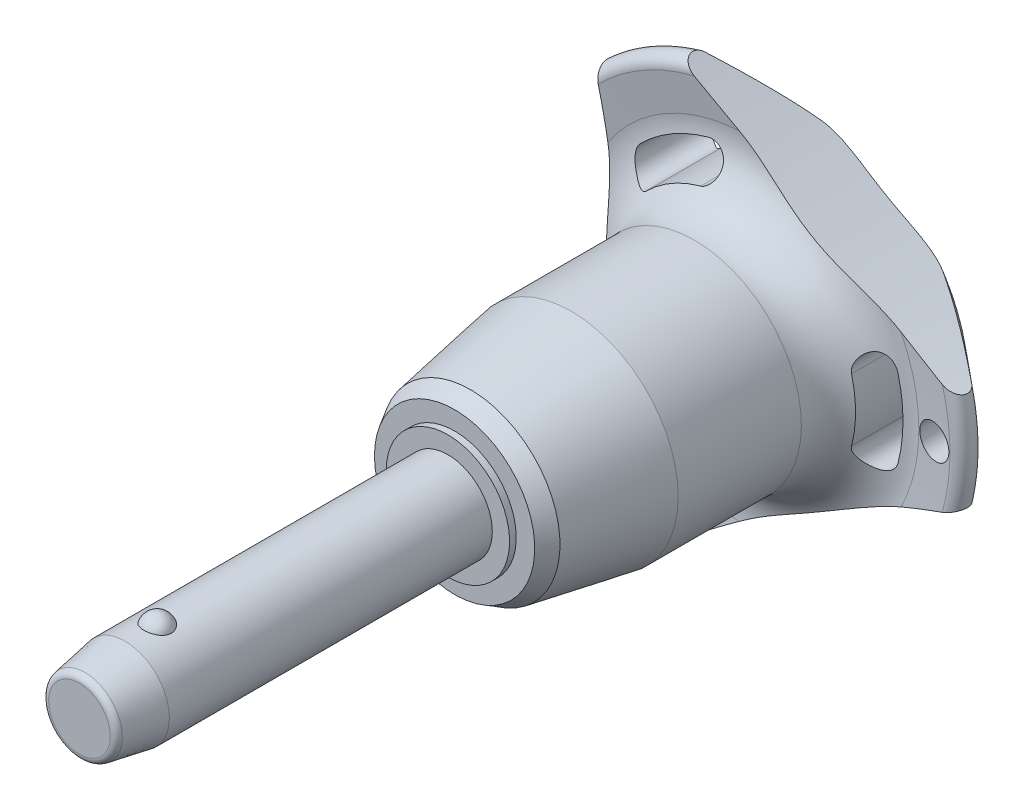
from build123d import *

# Parameters (mm, degrees)
SKETCH1_R           = 4
BOSS_EXTRUDE1_DEPTH = 25
SKETCH2_R           = 3.4
BOSS_EXTRUDE2_DEPTH = 33.3
BOSS_EXTRUDE3_START = 8.2
SKETCH1_2_R         = 4
BOSS_EXTRUDE3_DEPTH = 8.2
CHAMFER1_SIZE       = 4.1
CHAMFER1_SIZE2      = 0.722940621
FILLET1_R           = 0.6
SKETCH6_R           = 102.8
CUT_EXTRUDE1_DEPTH  = 65.557185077
CIRPATTERN1_COUNT   = 3
SKETCH7_R           = 1.5
CUT_EXTRUDE2_DEPTH  = 65.306162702


with BuildPart() as part:
    # Sketch1 → Boss-Extrude1 (new body)
    with BuildSketch(Plane.XY):
        Circle(SKETCH1_R)
    extrude(amount=-BOSS_EXTRUDE1_DEPTH)

    # Sketch2 → Boss-Extrude2 (add)
    with BuildSketch(Plane(origin=(0, 0, -25), x_dir=(-1, 0, 0), z_dir=(0, 0, -1))):
        Circle(SKETCH2_R)
    extrude(amount=BOSS_EXTRUDE2_DEPTH)

    # Sketch3 → Revolve1 (revolve)
    with BuildSketch(Plane(origin=(0, 0, 0), x_dir=(0, 0, -1), z_dir=(1, 0, 0))):
        with BuildLine():
            Line((-1.2, 4.8), (-1.2, 2.2))
            ThreePointArc((-1.2, 2.2), (0.1, 3.5), (-1.2, 4.8))
        make_face()
        with BuildLine():
            Line((-1.2, -2.2), (-1.2, -4.8))
            ThreePointArc((-1.2, -4.8), (0.1, -3.5), (-1.2, -2.2))
        make_face()
    revolve(axis=Axis((0, -2.2, 1.2), (0, 1, 0)))

    # Sketch1_2 → Boss-Extrude3 (add)
    with BuildSketch(Plane.XY.offset(BOSS_EXTRUDE3_START)):
        Circle(SKETCH1_2_R)
    extrude(amount=-BOSS_EXTRUDE3_DEPTH)

    # Chamfer1
    chamfer1_edges = [part.edges().sort_by_distance(p)[0] for p in [
        (-4, 0, 8.2),
    ]]
    chamfer1_side = [part.faces().sort_by_distance(p)[0] for p in [
        (-4, 0, -8.4),
    ]]
    chamfer(chamfer1_edges, length=CHAMFER1_SIZE, length2=CHAMFER1_SIZE2, reference=chamfer1_side[0])

    # Fillet1
    fillet1_edges = [part.edges().sort_by_distance(p)[0] for p in [
        (-3.277059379, 0, 8.2),
        (3.4, 0, -58.3),
    ]]
    fillet(fillet1_edges, radius=FILLET1_R)

    # Sketch4 → Revolve2 (revolve)
    with BuildSketch(Plane(origin=(0, 0, 0), x_dir=(0, 0, -1), z_dir=(1, 0, 0)), mode=Mode.PRIVATE) as revolve2_sk:
        Polygon((25, 0), (25, 5.554101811), (25.6, 5.554101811), (25.6, 7.220004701), (27.042714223, 8.052956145), (36.1, 9.65), (47.2, 9.65), (47.2, 0), align=None)
    revolve(revolve2_sk.sketch.rotate(Axis((0, 0, -47.2), (0, 0, 1)), 90), axis=Axis((0, 0, -47.2), (0, 0, 1)))

    # Sketch5 → Revolve3 (revolve)
    with BuildSketch(Plane(origin=(0, 0, 0), x_dir=(0, 0, -1), z_dir=(1, 0, 0)), mode=Mode.PRIVATE) as revolve3_sk:
        with BuildLine():
            Line((52.16082631, 15.274661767), (51.757834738, 18.475067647))
            ThreePointArc((51.757834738, 18.475067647), (52.349836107, 19.516443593), (53.516044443, 19.24278761))
            Line((53.516044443, 19.24278761), (57.835691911, 14.094832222))
            ThreePointArc((57.835691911, 14.094832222), (58.3, 12.689260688), (57.67067517, 11.349423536))
            ThreePointArc((57.67067517, 11.349423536), (54.033110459, 6.185112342), (52.75, 0))
            Line((52.75, 0), (47.2, 0))
            Line((47.2, 0), (47.2, 9.65))
            ThreePointArc((47.2, 9.65), (50.949887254, 11.342683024), (52.16082631, 15.274661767))
        make_face()
    revolve(revolve3_sk.sketch.rotate(Axis((0, 0, -52.75), (0, 0, 1)), 90), axis=Axis((0, 0, -52.75), (0, 0, 1)))

    # Sketch6 → Cut-Extrude1 (cut, through all)
    with BuildSketch(Plane.XY):
        with Locations((-115.2, 0)):
            Circle(SKETCH6_R)
        with BuildLine():
            ThreePointArc((13.411913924, -3.529271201), (13.868496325, 0), (13.411913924, 3.529271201))
            ThreePointArc((13.411913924, 3.529271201), (11.694200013, 4.531299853), (10.692171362, 2.813585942))
            ThreePointArc((10.692171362, 2.813585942), (11.056165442, 0), (10.692171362, -2.813585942))
            ThreePointArc((10.692171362, -2.813585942), (11.694200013, -4.531299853), (13.411913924, -3.529271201))
        make_face()
    cut_extrude1 = extrude(amount=-CUT_EXTRUDE1_DEPTH, mode=Mode.SUBTRACT)

    # CirPattern1: Cut-Extrude1 ×3 about axis
    cirpattern1_axis = Axis((0, 0, 0), (0, 0, 1))
    for i in range(1, CIRPATTERN1_COUNT):
        add(cut_extrude1.rotate(cirpattern1_axis, i * 360 / CIRPATTERN1_COUNT), mode=Mode.SUBTRACT)

    # Sketch7 → Cut-Extrude2 (cut, through all)
    with BuildSketch(Plane.XY):
        with Locations(Location((16.868496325, 0, 0), (0, 0, 225.467095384))):
            Circle(SKETCH7_R)
    extrude(amount=-CUT_EXTRUDE2_DEPTH, mode=Mode.SUBTRACT)


solid = part.part
